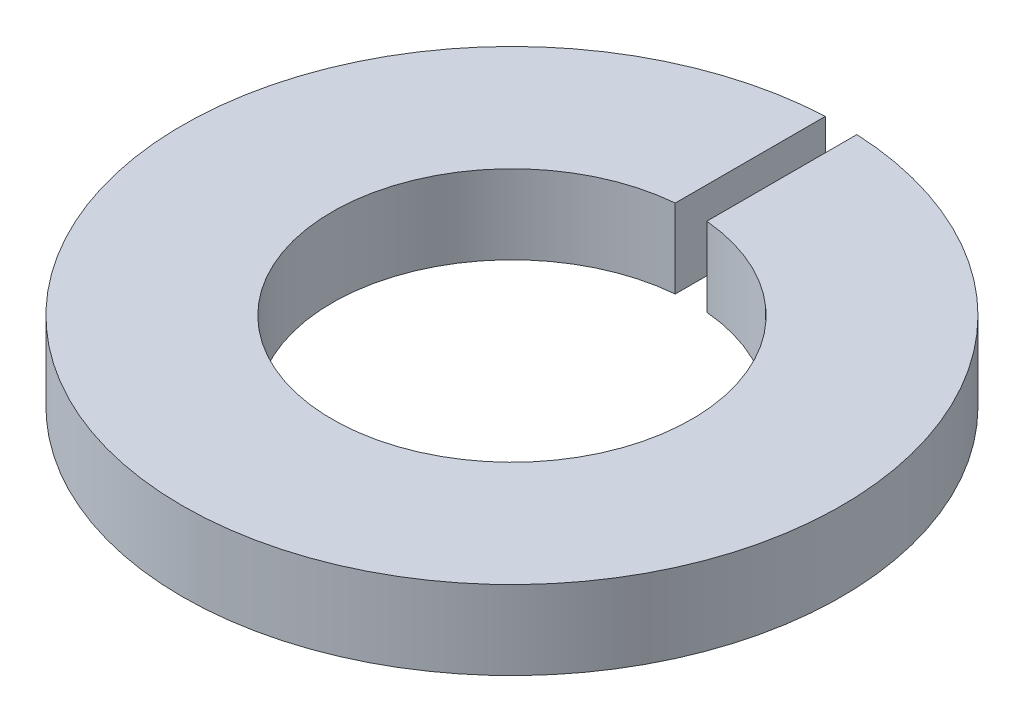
ISO-10303-21;
HEADER;
FILE_DESCRIPTION(('STEP AP214'),'2;1');
FILE_NAME('part.step','',(''),(''),'','','');
FILE_SCHEMA(('AUTOMOTIVE_DESIGN { 1 0 10303 214 1 1 1 1 }'));
ENDSEC;
DATA;
#1=APPLICATION_CONTEXT('core data for automotive mechanical design processes');
#2=APPLICATION_PROTOCOL_DEFINITION('international standard','automotive_design',2000,#1);
#3=PRODUCT_CONTEXT('',#1,'mechanical');
#4=PRODUCT('Part','Part','',(#3));
#5=PRODUCT_RELATED_PRODUCT_CATEGORY('part','',(#4));
#6=PRODUCT_DEFINITION_FORMATION('','',#4);
#7=PRODUCT_DEFINITION_CONTEXT('part definition',#1,'design');
#8=PRODUCT_DEFINITION('design','',#6,#7);
#9=PRODUCT_DEFINITION_SHAPE('','',#8);
#10=(LENGTH_UNIT() NAMED_UNIT(*) SI_UNIT(.MILLI.,.METRE.));
#11=(NAMED_UNIT(*) PLANE_ANGLE_UNIT() SI_UNIT($,.RADIAN.));
#12=(NAMED_UNIT(*) SI_UNIT($,.STERADIAN.) SOLID_ANGLE_UNIT());
#13=UNCERTAINTY_MEASURE_WITH_UNIT(LENGTH_MEASURE(1.E-05),#10,'distance_accuracy_value','');
#14=(GEOMETRIC_REPRESENTATION_CONTEXT(3) GLOBAL_UNCERTAINTY_ASSIGNED_CONTEXT((#13)) GLOBAL_UNIT_ASSIGNED_CONTEXT((#10,
#11,#12)) REPRESENTATION_CONTEXT('',''));
#15=CARTESIAN_POINT('',(0.,0.,0.));
#16=DIRECTION('',(0.,0.,1.));
#17=DIRECTION('',(1.,0.,0.));
#18=AXIS2_PLACEMENT_3D('',#15,#16,#17);
#19=CARTESIAN_POINT('',(0.,0.635,0.));
#20=DIRECTION('',(0.,1.,0.));
#21=DIRECTION('',(0.,0.,1.));
#22=AXIS2_PLACEMENT_3D('',#19,#20,#21);
#23=PLANE('',#22);
#24=CARTESIAN_POINT('',(0.,0.635,0.));
#25=DIRECTION('',(0.,1.,0.));
#26=DIRECTION('',(0.,0.,1.));
#27=AXIS2_PLACEMENT_3D('',#24,#25,#26);
#28=CIRCLE('',#27,1.4478);
#29=CARTESIAN_POINT('',(-0.127,0.635,-1.44221906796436));
#30=VERTEX_POINT('',#29);
#31=CARTESIAN_POINT('',(0.127,0.635,-1.44221906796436));
#32=VERTEX_POINT('',#31);
#33=EDGE_CURVE('E89',#30,#32,#28,.T.);
#34=ORIENTED_EDGE('',*,*,#33,.F.);
#35=DIRECTION('',(0.,0.,1.));
#36=VECTOR('',#35,1.);
#37=CARTESIAN_POINT('',(-0.127,0.635,-2.6543));
#38=LINE('',#37,#36);
#39=CARTESIAN_POINT('',(-0.127,0.635,-2.65125998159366));
#40=VERTEX_POINT('',#39);
#41=EDGE_CURVE('E54',#40,#30,#38,.T.);
#42=ORIENTED_EDGE('',*,*,#41,.F.);
#43=CARTESIAN_POINT('',(0.,0.635,0.));
#44=DIRECTION('',(0.,1.,0.));
#45=DIRECTION('',(0.,0.,1.));
#46=AXIS2_PLACEMENT_3D('',#43,#44,#45);
#47=CIRCLE('',#46,2.6543);
#48=CARTESIAN_POINT('',(0.127,0.635,-2.65125998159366));
#49=VERTEX_POINT('',#48);
#50=EDGE_CURVE('E84',#40,#49,#47,.T.);
#51=ORIENTED_EDGE('',*,*,#50,.T.);
#52=DIRECTION('',(0.,0.,-1.));
#53=VECTOR('',#52,1.);
#54=CARTESIAN_POINT('',(0.127,0.635,-2.6543));
#55=LINE('',#54,#53);
#56=EDGE_CURVE('E101',#32,#49,#55,.T.);
#57=ORIENTED_EDGE('',*,*,#56,.F.);
#58=EDGE_LOOP('',(#34,#42,#51,#57));
#59=FACE_BOUND('',#58,.T.);
#60=ADVANCED_FACE('F31',(#59),#23,.T.);
#61=CARTESIAN_POINT('',(0.,0.,0.));
#62=DIRECTION('',(0.,1.,0.));
#63=DIRECTION('',(0.,0.,1.));
#64=AXIS2_PLACEMENT_3D('',#61,#62,#63);
#65=PLANE('',#64);
#66=DIRECTION('',(0.,0.,1.));
#67=VECTOR('',#66,1.);
#68=CARTESIAN_POINT('',(-0.127,0.,-2.6543));
#69=LINE('',#68,#67);
#70=CARTESIAN_POINT('',(-0.127,0.,-2.65125998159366));
#71=VERTEX_POINT('',#70);
#72=CARTESIAN_POINT('',(-0.127,0.,-1.44221906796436));
#73=VERTEX_POINT('',#72);
#74=EDGE_CURVE('E69',#71,#73,#69,.T.);
#75=ORIENTED_EDGE('',*,*,#74,.T.);
#76=CARTESIAN_POINT('',(0.,0.,0.));
#77=DIRECTION('',(0.,1.,0.));
#78=DIRECTION('',(0.,0.,1.));
#79=AXIS2_PLACEMENT_3D('',#76,#77,#78);
#80=CIRCLE('',#79,1.4478);
#81=CARTESIAN_POINT('',(0.127,0.,-1.44221906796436));
#82=VERTEX_POINT('',#81);
#83=EDGE_CURVE('E85',#73,#82,#80,.T.);
#84=ORIENTED_EDGE('',*,*,#83,.T.);
#85=DIRECTION('',(0.,0.,-1.));
#86=VECTOR('',#85,1.);
#87=CARTESIAN_POINT('',(0.127,0.,-2.6543));
#88=LINE('',#87,#86);
#89=CARTESIAN_POINT('',(0.127,0.,-2.65125998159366));
#90=VERTEX_POINT('',#89);
#91=EDGE_CURVE('E46',#82,#90,#88,.T.);
#92=ORIENTED_EDGE('',*,*,#91,.T.);
#93=CARTESIAN_POINT('',(0.,0.,0.));
#94=DIRECTION('',(0.,1.,0.));
#95=DIRECTION('',(0.,0.,1.));
#96=AXIS2_PLACEMENT_3D('',#93,#94,#95);
#97=CIRCLE('',#96,2.6543);
#98=EDGE_CURVE('E82',#71,#90,#97,.T.);
#99=ORIENTED_EDGE('',*,*,#98,.F.);
#100=EDGE_LOOP('',(#75,#84,#92,#99));
#101=FACE_BOUND('',#100,.T.);
#102=ADVANCED_FACE('F88',(#101),#65,.F.);
#103=CARTESIAN_POINT('',(0.,0.635,0.));
#104=DIRECTION('',(0.,-1.,0.));
#105=DIRECTION('',(0.,0.,-1.));
#106=AXIS2_PLACEMENT_3D('',#103,#104,#105);
#107=CYLINDRICAL_SURFACE('',#106,2.6543);
#108=DIRECTION('',(0.,-1.,0.));
#109=VECTOR('',#108,1.);
#110=CARTESIAN_POINT('',(-0.127,0.635,-2.65125998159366));
#111=LINE('',#110,#109);
#112=EDGE_CURVE('E72',#71,#40,#111,.F.);
#113=ORIENTED_EDGE('',*,*,#112,.F.);
#114=ORIENTED_EDGE('',*,*,#98,.T.);
#115=DIRECTION('',(0.,-1.,0.));
#116=VECTOR('',#115,1.);
#117=CARTESIAN_POINT('',(0.127,0.635,-2.65125998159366));
#118=LINE('',#117,#116);
#119=EDGE_CURVE('E86',#49,#90,#118,.T.);
#120=ORIENTED_EDGE('',*,*,#119,.F.);
#121=ORIENTED_EDGE('',*,*,#50,.F.);
#122=EDGE_LOOP('',(#113,#114,#120,#121));
#123=FACE_BOUND('',#122,.T.);
#124=ADVANCED_FACE('F33',(#123),#107,.T.);
#125=CARTESIAN_POINT('',(0.,0.635,0.));
#126=DIRECTION('',(0.,-1.,0.));
#127=DIRECTION('',(0.,0.,-1.));
#128=AXIS2_PLACEMENT_3D('',#125,#126,#127);
#129=CYLINDRICAL_SURFACE('',#128,1.4478);
#130=ORIENTED_EDGE('',*,*,#83,.F.);
#131=DIRECTION('',(0.,-1.,0.));
#132=VECTOR('',#131,1.);
#133=CARTESIAN_POINT('',(-0.127,0.635,-1.44221906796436));
#134=LINE('',#133,#132);
#135=EDGE_CURVE('E11',#73,#30,#134,.F.);
#136=ORIENTED_EDGE('',*,*,#135,.T.);
#137=ORIENTED_EDGE('',*,*,#33,.T.);
#138=DIRECTION('',(0.,-1.,0.));
#139=VECTOR('',#138,1.);
#140=CARTESIAN_POINT('',(0.127,0.635,-1.44221906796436));
#141=LINE('',#140,#139);
#142=EDGE_CURVE('E39',#32,#82,#141,.T.);
#143=ORIENTED_EDGE('',*,*,#142,.T.);
#144=EDGE_LOOP('',(#130,#136,#137,#143));
#145=FACE_BOUND('',#144,.T.);
#146=ADVANCED_FACE('F96',(#145),#129,.F.);
#147=CARTESIAN_POINT('',(0.127,0.635,-2.6543));
#148=DIRECTION('',(-1.,0.,0.));
#149=DIRECTION('',(0.,0.,1.));
#150=AXIS2_PLACEMENT_3D('',#147,#148,#149);
#151=PLANE('',#150);
#152=ORIENTED_EDGE('',*,*,#119,.T.);
#153=ORIENTED_EDGE('',*,*,#91,.F.);
#154=ORIENTED_EDGE('',*,*,#142,.F.);
#155=ORIENTED_EDGE('',*,*,#56,.T.);
#156=EDGE_LOOP('',(#152,#153,#154,#155));
#157=FACE_BOUND('',#156,.T.);
#158=ADVANCED_FACE('F104',(#157),#151,.T.);
#159=CARTESIAN_POINT('',(-0.127,0.635,-2.6543));
#160=DIRECTION('',(1.,0.,0.));
#161=DIRECTION('',(0.,0.,-1.));
#162=AXIS2_PLACEMENT_3D('',#159,#160,#161);
#163=PLANE('',#162);
#164=ORIENTED_EDGE('',*,*,#112,.T.);
#165=ORIENTED_EDGE('',*,*,#41,.T.);
#166=ORIENTED_EDGE('',*,*,#135,.F.);
#167=ORIENTED_EDGE('',*,*,#74,.F.);
#168=EDGE_LOOP('',(#164,#165,#166,#167));
#169=FACE_BOUND('',#168,.T.);
#170=ADVANCED_FACE('F71',(#169),#163,.T.);
#171=CLOSED_SHELL('',(#60,#102,#124,#146,#158,#170));
#172=MANIFOLD_SOLID_BREP('B2',#171);
#173=ADVANCED_BREP_SHAPE_REPRESENTATION('',(#18,#172),#14);
#174=SHAPE_DEFINITION_REPRESENTATION(#9,#173);
ENDSEC;
END-ISO-10303-21;
